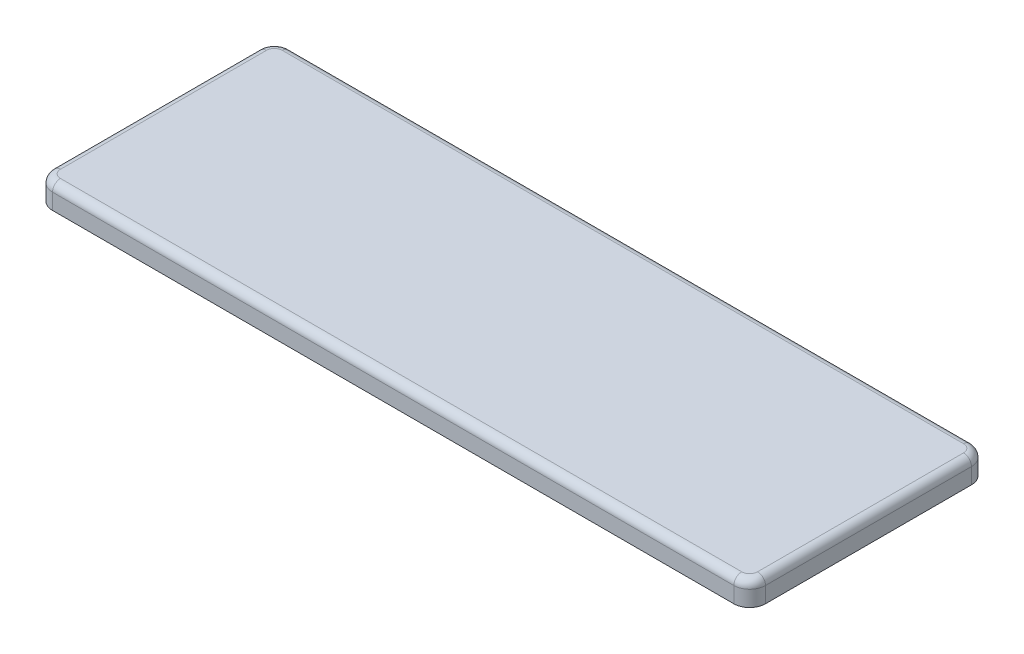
from build123d import *

# Parameters (mm, degrees)
EXTRUDE_1_DEPTH           = 1.5
FILLET_1_R                = 1
CUT_EXTRUDE_2_DEPTH       = 1
SKETCH_4_W                = 3.3
SKETCH_4_H                = 4.9
EXTRUDE_4_DEPTH           = 8
EXTRUDE_4_DRAFT           = 0.6
EXTRUDE_4_PROFILE_2_DEPTH = 8
EXTRUDE_4_PROFILE_2_DRAFT = 0.6
EXTRUDE_4_PROFILE_3_DEPTH = 8
EXTRUDE_4_PROFILE_3_DRAFT = 0.6
FILLET_2_R                = 0.8


with BuildPart() as part:
    # Sketch 1 → Extrude 1 (new, symmetric)
    with BuildSketch(Plane(origin=(0, 0, 0), x_dir=(0, 0, -1), z_dir=(0, 1, 0))):
        with BuildLine():
            Line((-13, 45), (13, 45))
            ThreePointArc((13, 45), (14.414213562, 44.414213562), (15, 43))
            Line((15, 43), (15, -43))
            ThreePointArc((15, -43), (14.414213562, -44.414213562), (13, -45))
            Line((13, -45), (-13, -45))
            ThreePointArc((-13, -45), (-14.414213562, -44.414213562), (-15, -43))
            Line((-15, -43), (-15, 43))
            ThreePointArc((-15, 43), (-14.414213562, 44.414213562), (-13, 45))
        make_face()
    extrude(amount=EXTRUDE_1_DEPTH, both=True)

    # Fillet 1
    fillet_1_edges = [part.edges().sort_by_distance(p)[0] for p in [
        (-44.414213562, 1.5, 14.414213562),
        (0, 1.5, 15),
        (44.414213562, 1.5, 14.414213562),
        (45, 1.5, 0),
        (44.414213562, 1.5, -14.414213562),
        (0, 1.5, -15),
        (-44.414213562, 1.5, -14.414213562),
        (-45, 1.5, 0),
    ]]
    fillet(fillet_1_edges, radius=FILLET_1_R)

    # Sketch 2 → Cut-Extrude 2 (cut)
    with BuildSketch(Plane.XZ.offset(1.5)):
        with BuildLine():
            Line((-43, 13.2), (43, 13.2))
            ThreePointArc((43, 13.2), (43.141421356, 13.141421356), (43.2, 13))
            Line((43.2, 13), (43.2, -13))
            ThreePointArc((43.2, -13), (43.141421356, -13.141421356), (43, -13.2))
            Line((43, -13.2), (-43, -13.2))
            ThreePointArc((-43, -13.2), (-43.141421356, -13.141421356), (-43.2, -13))
            Line((-43.2, -13), (-43.2, 13))
            ThreePointArc((-43.2, 13), (-43.141421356, 13.141421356), (-43, 13.2))
        make_face()
    extrude(amount=-CUT_EXTRUDE_2_DEPTH, mode=Mode.SUBTRACT)


with BuildPart() as extrude_4_tool:
    # Sketch 4 → Extrude 4 (with draft: the straight prism first)
    with BuildSketch(Plane.XZ.offset(0.5)):
        with Locations((-30, 0)):
            Rectangle(SKETCH_4_W, SKETCH_4_H)
    extrude(amount=EXTRUDE_4_DEPTH)
    # Extrude 4: the draft: its side faces are tilted about the plane it starts from
    extrude_4_sides = [extrude_4_tool.faces().sort_by_distance(p)[0] for p in [
        (-31.65, -4.5, 0),
        (-30, -4.5, -2.45),
        (-28.35, -4.5, 0),
        (-30, -4.5, 2.45),
    ]]
    draft(extrude_4_sides, Plane.XZ.offset(0.5), EXTRUDE_4_DRAFT)


with BuildPart() as part_1:
    add(part.part)

    # Extrude 4: add extrude_4_tool
    add(extrude_4_tool.part)


with BuildPart() as extrude_4_profile_2_tool:
    # Sketch 4 → Extrude 4 profile 2 (with draft: the straight prism first)
    with BuildSketch(Plane.XZ.offset(0.5)):
        with Locations((30, 0)):
            Rectangle(SKETCH_4_W, SKETCH_4_H)
    extrude(amount=EXTRUDE_4_PROFILE_2_DEPTH)
    # Extrude 4 profile 2: the draft: its side faces are tilted about the plane it starts from
    extrude_4_profile_2_sides = [extrude_4_profile_2_tool.faces().sort_by_distance(p)[0] for p in [
        (30, -4.5, -2.45),
        (31.65, -4.5, 0),
        (30, -4.5, 2.45),
        (28.35, -4.5, 0),
    ]]
    draft(extrude_4_profile_2_sides, Plane.XZ.offset(0.5), EXTRUDE_4_PROFILE_2_DRAFT)


with BuildPart() as part_2:
    add(part_1.part)

    # Extrude 4 profile 2: add extrude_4_profile_2_tool
    add(extrude_4_profile_2_tool.part)


with BuildPart() as extrude_4_profile_3_tool:
    # Sketch 4 → Extrude 4 profile 3 (with draft: the straight prism first)
    with BuildSketch(Plane.XZ.offset(0.5)):
        Rectangle(SKETCH_4_W, SKETCH_4_H)
    extrude(amount=EXTRUDE_4_PROFILE_3_DEPTH)
    # Extrude 4 profile 3: the draft: its side faces are tilted about the plane it starts from
    extrude_4_profile_3_sides = [extrude_4_profile_3_tool.faces().sort_by_distance(p)[0] for p in [
        (-1.65, -4.5, 0),
        (0, -4.5, -2.45),
        (1.65, -4.5, 0),
        (0, -4.5, 2.45),
    ]]
    draft(extrude_4_profile_3_sides, Plane.XZ.offset(0.5), EXTRUDE_4_PROFILE_3_DRAFT)


with BuildPart() as part_3:
    add(part_2.part)

    # Extrude 4 profile 3: add extrude_4_profile_3_tool
    add(extrude_4_profile_3_tool.part)

    # Fillet 2
    fillet_2_edges = [part_3.edges().sort_by_distance(p)[0] for p in [
        (-31.566221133, -8.5, 0),
        (-30, -8.5, -2.366221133),
        (-28.433778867, -8.5, 0),
        (-30, -8.5, 2.366221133),
        (28.433778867, -8.5, 0),
        (30, -8.5, -2.366221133),
        (31.566221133, -8.5, 0),
        (30, -8.5, 2.366221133),
        (-1.566221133, -8.5, 0),
        (0, -8.5, -2.366221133),
        (1.566221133, -8.5, 0),
        (0, -8.5, 2.366221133),
    ]]
    fillet(fillet_2_edges, radius=FILLET_2_R)


solid = part_3.part
